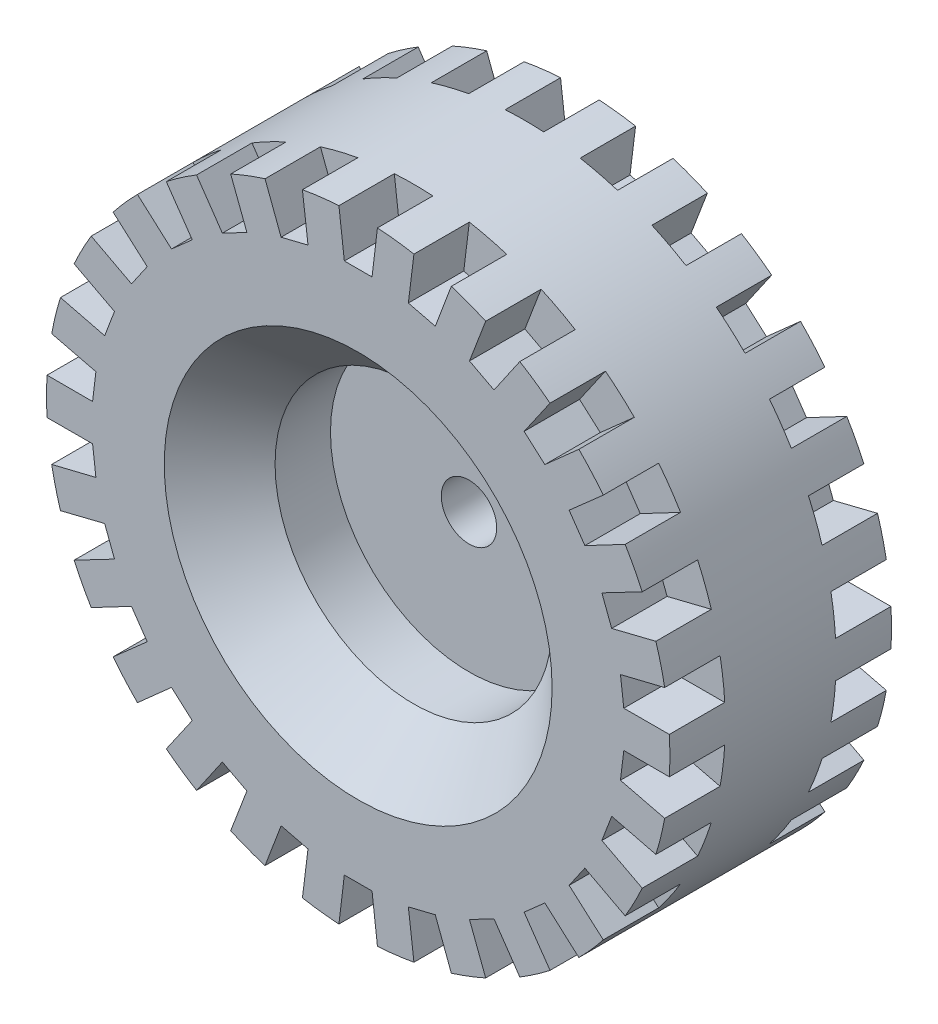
from build123d import *

# Parameters (mm, degrees)
SKETCH1_R      = 22.5
SKETCH1_R_2    = 2
EXTRUDE1_DEPTH = 8
SKETCH2_R      = 10
EXTRUDE2_DEPTH = 8
CHAMFER1_SIZE  = 4
EXTRUDE3_DEPTH = 4


with BuildPart() as part:
    # Sketch1 → Extrude1 (new, symmetric)
    with BuildSketch(Plane.XY):
        Circle(SKETCH1_R)
        Circle(SKETCH1_R_2, mode=Mode.SUBTRACT)
    extrude(amount=EXTRUDE1_DEPTH, both=True)

    # Sketch2 → Extrude2 (cut)
    with BuildSketch(Plane.XY.offset(8)):
        Circle(SKETCH2_R)
    extrude(amount=-EXTRUDE2_DEPTH, mode=Mode.SUBTRACT)

    # Chamfer1
    chamfer1_edges = [part.edges().sort_by_distance(p)[0] for p in [
        (-10, 0, 8),
    ]]
    chamfer(chamfer1_edges, length=CHAMFER1_SIZE)

    # Sketch3 → Extrude3 (cut)
    with BuildSketch(Plane.XY.offset(8)):
        Polygon((-1, 19.193657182), (1, 19.193657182), (1.5, 23.371456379), (-1.5, 23.371456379), align=None)
        Polygon((7.049568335, 22.333350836), (4.136742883, 23.051297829), (3.622401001, 18.875240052), (5.564284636, 18.396608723), align=None)
        Polygon((12.189441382, 19.997312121), (9.533073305, 21.391481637), (8.034281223, 17.459862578), (9.805193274, 16.530416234), align=None)
        Polygon((16.620908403, 16.499102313), (14.375376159, 18.488470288), (11.979238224, 15.029781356), (13.47625972, 13.703536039), align=None)
        Polygon((20.086428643, 12.04202465), (18.382234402, 14.510976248), (15.228005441, 11.726223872), (16.364134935, 10.08025614), align=None)
        Polygon((22.38459866, 6.885108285), (21.320783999, 9.690157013), (17.591776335, 7.74118088), (18.300986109, 5.871148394), align=None)
        Polygon((23.381857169, 1.328054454), (23.020247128, 4.306181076), (18.933177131, 3.306248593), (19.174250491, 1.320830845), align=None)
        Polygon((23.020247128, -4.306181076), (23.381857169, -1.328054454), (19.174250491, -1.320830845), (18.933177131, -3.306248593), align=None)
        Polygon((21.320783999, -9.690157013), (22.38459866, -6.885108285), (18.300986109, -5.871148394), (17.591776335, -7.74118088), align=None)
        Polygon((18.382234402, -14.510976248), (20.086428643, -12.04202465), (16.364134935, -10.08025614), (15.228005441, -11.726223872), align=None)
        Polygon((14.375376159, -18.488470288), (16.620908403, -16.499102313), (13.47625972, -13.703536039), (11.979238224, -15.029781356), align=None)
        Polygon((9.533073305, -21.391481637), (12.189441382, -19.997312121), (9.805193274, -16.530416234), (8.034281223, -17.459862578), align=None)
        Polygon((4.136742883, -23.051297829), (7.049568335, -22.333350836), (5.564284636, -18.396608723), (3.622401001, -18.875240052), align=None)
        Polygon((-1.5, -23.371456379), (1.5, -23.371456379), (1, -19.193657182), (-1, -19.193657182), align=None)
        Polygon((-7.049568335, -22.333350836), (-4.136742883, -23.051297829), (-3.622401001, -18.875240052), (-5.564284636, -18.396608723), align=None)
        Polygon((-12.189441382, -19.997312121), (-9.533073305, -21.391481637), (-8.034281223, -17.459862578), (-9.805193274, -16.530416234), align=None)
        Polygon((-16.620908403, -16.499102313), (-14.375376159, -18.488470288), (-11.979238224, -15.029781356), (-13.47625972, -13.703536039), align=None)
        Polygon((-20.086428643, -12.04202465), (-18.382234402, -14.510976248), (-15.228005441, -11.726223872), (-16.364134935, -10.08025614), align=None)
        Polygon((-22.38459866, -6.885108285), (-21.320783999, -9.690157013), (-17.591776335, -7.74118088), (-18.300986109, -5.871148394), align=None)
        Polygon((-23.381857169, -1.328054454), (-23.020247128, -4.306181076), (-18.933177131, -3.306248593), (-19.174250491, -1.320830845), align=None)
        Polygon((-23.020247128, 4.306181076), (-23.381857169, 1.328054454), (-19.174250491, 1.320830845), (-18.933177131, 3.306248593), align=None)
        Polygon((-21.320783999, 9.690157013), (-22.38459866, 6.885108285), (-18.300986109, 5.871148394), (-17.591776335, 7.74118088), align=None)
        Polygon((-18.382234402, 14.510976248), (-20.086428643, 12.04202465), (-16.364134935, 10.08025614), (-15.228005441, 11.726223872), align=None)
        Polygon((-14.375376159, 18.488470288), (-16.620908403, 16.499102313), (-13.47625972, 13.703536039), (-11.979238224, 15.029781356), align=None)
        Polygon((-9.533073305, 21.391481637), (-12.189441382, 19.997312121), (-9.805193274, 16.530416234), (-8.034281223, 17.459862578), align=None)
        Polygon((-4.136742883, 23.051297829), (-7.049568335, 22.333350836), (-5.564284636, 18.396608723), (-3.622401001, 18.875240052), align=None)
    extrude3 = extrude(amount=-EXTRUDE3_DEPTH, mode=Mode.SUBTRACT)

    # Mirror1: Extrude3 across plane
    add(extrude3.mirror(Plane.XY), mode=Mode.SUBTRACT)


solid = part.part
